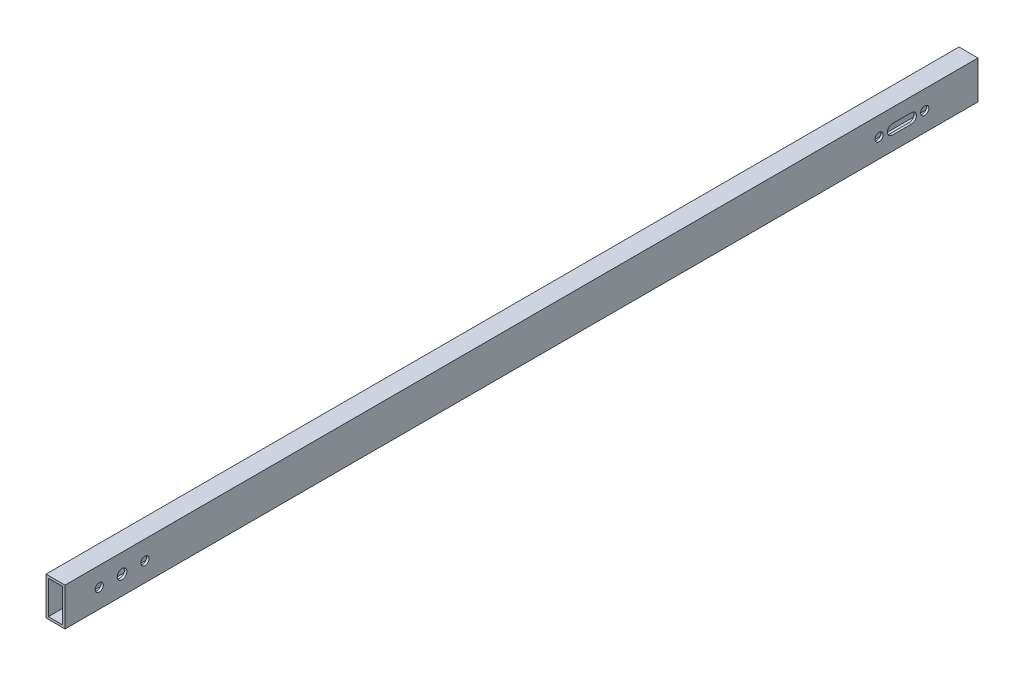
ISO-10303-21;
HEADER;
FILE_DESCRIPTION(('STEP AP214'),'2;1');
FILE_NAME('part.step','',(''),(''),'','','');
FILE_SCHEMA(('AUTOMOTIVE_DESIGN { 1 0 10303 214 1 1 1 1 }'));
ENDSEC;
DATA;
#1=APPLICATION_CONTEXT('core data for automotive mechanical design processes');
#2=APPLICATION_PROTOCOL_DEFINITION('international standard','automotive_design',2000,#1);
#3=PRODUCT_CONTEXT('',#1,'mechanical');
#4=PRODUCT('Part','Part','',(#3));
#5=PRODUCT_RELATED_PRODUCT_CATEGORY('part','',(#4));
#6=PRODUCT_DEFINITION_FORMATION('','',#4);
#7=PRODUCT_DEFINITION_CONTEXT('part definition',#1,'design');
#8=PRODUCT_DEFINITION('design','',#6,#7);
#9=PRODUCT_DEFINITION_SHAPE('','',#8);
#10=(LENGTH_UNIT() NAMED_UNIT(*) SI_UNIT(.MILLI.,.METRE.));
#11=(NAMED_UNIT(*) PLANE_ANGLE_UNIT() SI_UNIT($,.RADIAN.));
#12=(NAMED_UNIT(*) SI_UNIT($,.STERADIAN.) SOLID_ANGLE_UNIT());
#13=UNCERTAINTY_MEASURE_WITH_UNIT(LENGTH_MEASURE(1.E-05),#10,'distance_accuracy_value','');
#14=(GEOMETRIC_REPRESENTATION_CONTEXT(3) GLOBAL_UNCERTAINTY_ASSIGNED_CONTEXT((#13)) GLOBAL_UNIT_ASSIGNED_CONTEXT((#10,
#11,#12)) REPRESENTATION_CONTEXT('',''));
#15=CARTESIAN_POINT('',(0.,0.,0.));
#16=DIRECTION('',(0.,0.,1.));
#17=DIRECTION('',(1.,0.,0.));
#18=AXIS2_PLACEMENT_3D('',#15,#16,#17);
#19=CARTESIAN_POINT('',(0.,0.,609.6));
#20=DIRECTION('',(0.,0.,-1.));
#21=DIRECTION('',(-1.,0.,0.));
#22=AXIS2_PLACEMENT_3D('',#19,#20,#21);
#23=PLANE('',#22);
#24=DIRECTION('',(0.,1.,0.));
#25=VECTOR('',#24,1.);
#26=CARTESIAN_POINT('',(6.35,-12.7,609.6));
#27=LINE('',#26,#25);
#28=CARTESIAN_POINT('',(6.35,-12.7,609.6));
#29=VERTEX_POINT('',#28);
#30=CARTESIAN_POINT('',(6.35,12.7,609.6));
#31=VERTEX_POINT('',#30);
#32=EDGE_CURVE('E341',#29,#31,#27,.T.);
#33=ORIENTED_EDGE('',*,*,#32,.T.);
#34=DIRECTION('',(-1.,0.,0.));
#35=VECTOR('',#34,1.);
#36=CARTESIAN_POINT('',(-6.35,12.7,609.6));
#37=LINE('',#36,#35);
#38=CARTESIAN_POINT('',(-6.35,12.7,609.6));
#39=VERTEX_POINT('',#38);
#40=EDGE_CURVE('E344',#31,#39,#37,.T.);
#41=ORIENTED_EDGE('',*,*,#40,.T.);
#42=DIRECTION('',(0.,-1.,0.));
#43=VECTOR('',#42,1.);
#44=CARTESIAN_POINT('',(-6.35,-12.7,609.6));
#45=LINE('',#44,#43);
#46=CARTESIAN_POINT('',(-6.35,-12.7,609.6));
#47=VERTEX_POINT('',#46);
#48=EDGE_CURVE('E347',#39,#47,#45,.T.);
#49=ORIENTED_EDGE('',*,*,#48,.T.);
#50=DIRECTION('',(1.,0.,0.));
#51=VECTOR('',#50,1.);
#52=CARTESIAN_POINT('',(-6.35,-12.7,609.6));
#53=LINE('',#52,#51);
#54=EDGE_CURVE('E349',#47,#29,#53,.T.);
#55=ORIENTED_EDGE('',*,*,#54,.T.);
#56=EDGE_LOOP('',(#33,#41,#49,#55));
#57=FACE_BOUND('',#56,.T.);
#58=DIRECTION('',(0.,1.,0.));
#59=VECTOR('',#58,1.);
#60=CARTESIAN_POINT('',(4.7625,-11.1125,609.6));
#61=LINE('',#60,#59);
#62=CARTESIAN_POINT('',(4.7625,-11.1125,609.6));
#63=VERTEX_POINT('',#62);
#64=CARTESIAN_POINT('',(4.7625,11.1125,609.6));
#65=VERTEX_POINT('',#64);
#66=EDGE_CURVE('E310',#63,#65,#61,.T.);
#67=ORIENTED_EDGE('',*,*,#66,.F.);
#68=DIRECTION('',(1.,0.,0.));
#69=VECTOR('',#68,1.);
#70=CARTESIAN_POINT('',(-4.7625,-11.1125,609.6));
#71=LINE('',#70,#69);
#72=CARTESIAN_POINT('',(-4.7625,-11.1125,609.6));
#73=VERTEX_POINT('',#72);
#74=EDGE_CURVE('E318',#73,#63,#71,.T.);
#75=ORIENTED_EDGE('',*,*,#74,.F.);
#76=DIRECTION('',(0.,-1.,0.));
#77=VECTOR('',#76,1.);
#78=CARTESIAN_POINT('',(-4.7625,-11.1125,609.6));
#79=LINE('',#78,#77);
#80=CARTESIAN_POINT('',(-4.7625,11.1125,609.6));
#81=VERTEX_POINT('',#80);
#82=EDGE_CURVE('E315',#81,#73,#79,.T.);
#83=ORIENTED_EDGE('',*,*,#82,.F.);
#84=DIRECTION('',(-1.,0.,0.));
#85=VECTOR('',#84,1.);
#86=CARTESIAN_POINT('',(-4.7625,11.1125,609.6));
#87=LINE('',#86,#85);
#88=EDGE_CURVE('E312',#65,#81,#87,.T.);
#89=ORIENTED_EDGE('',*,*,#88,.F.);
#90=EDGE_LOOP('',(#67,#75,#83,#89));
#91=FACE_BOUND('',#90,.T.);
#92=ADVANCED_FACE('F39',(#57,#91),#23,.F.);
#93=CARTESIAN_POINT('',(0.,0.,0.));
#94=DIRECTION('',(0.,0.,-1.));
#95=DIRECTION('',(-1.,0.,0.));
#96=AXIS2_PLACEMENT_3D('',#93,#94,#95);
#97=PLANE('',#96);
#98=DIRECTION('',(0.,1.,0.));
#99=VECTOR('',#98,1.);
#100=CARTESIAN_POINT('',(6.35,-12.7,0.));
#101=LINE('',#100,#99);
#102=CARTESIAN_POINT('',(6.35,-12.7,0.));
#103=VERTEX_POINT('',#102);
#104=CARTESIAN_POINT('',(6.35,12.7,0.));
#105=VERTEX_POINT('',#104);
#106=EDGE_CURVE('E340',#103,#105,#101,.T.);
#107=ORIENTED_EDGE('',*,*,#106,.F.);
#108=DIRECTION('',(1.,0.,0.));
#109=VECTOR('',#108,1.);
#110=CARTESIAN_POINT('',(-6.35,-12.7,0.));
#111=LINE('',#110,#109);
#112=CARTESIAN_POINT('',(-6.35,-12.7,0.));
#113=VERTEX_POINT('',#112);
#114=EDGE_CURVE('E345',#113,#103,#111,.T.);
#115=ORIENTED_EDGE('',*,*,#114,.F.);
#116=DIRECTION('',(0.,-1.,0.));
#117=VECTOR('',#116,1.);
#118=CARTESIAN_POINT('',(-6.35,-12.7,0.));
#119=LINE('',#118,#117);
#120=CARTESIAN_POINT('',(-6.35,12.7,0.));
#121=VERTEX_POINT('',#120);
#122=EDGE_CURVE('E356',#121,#113,#119,.T.);
#123=ORIENTED_EDGE('',*,*,#122,.F.);
#124=DIRECTION('',(-1.,0.,0.));
#125=VECTOR('',#124,1.);
#126=CARTESIAN_POINT('',(-6.35,12.7,0.));
#127=LINE('',#126,#125);
#128=EDGE_CURVE('E354',#105,#121,#127,.T.);
#129=ORIENTED_EDGE('',*,*,#128,.F.);
#130=EDGE_LOOP('',(#107,#115,#123,#129));
#131=FACE_BOUND('',#130,.T.);
#132=DIRECTION('',(1.,0.,0.));
#133=VECTOR('',#132,1.);
#134=CARTESIAN_POINT('',(-4.7625,-11.1125,0.));
#135=LINE('',#134,#133);
#136=CARTESIAN_POINT('',(-4.7625,-11.1125,0.));
#137=VERTEX_POINT('',#136);
#138=CARTESIAN_POINT('',(4.7625,-11.1125,0.));
#139=VERTEX_POINT('',#138);
#140=EDGE_CURVE('E313',#137,#139,#135,.T.);
#141=ORIENTED_EDGE('',*,*,#140,.T.);
#142=DIRECTION('',(0.,1.,0.));
#143=VECTOR('',#142,1.);
#144=CARTESIAN_POINT('',(4.7625,-11.1125,0.));
#145=LINE('',#144,#143);
#146=CARTESIAN_POINT('',(4.7625,11.1125,0.));
#147=VERTEX_POINT('',#146);
#148=EDGE_CURVE('E309',#139,#147,#145,.T.);
#149=ORIENTED_EDGE('',*,*,#148,.T.);
#150=DIRECTION('',(-1.,0.,0.));
#151=VECTOR('',#150,1.);
#152=CARTESIAN_POINT('',(-4.7625,11.1125,0.));
#153=LINE('',#152,#151);
#154=CARTESIAN_POINT('',(-4.7625,11.1125,0.));
#155=VERTEX_POINT('',#154);
#156=EDGE_CURVE('E323',#147,#155,#153,.T.);
#157=ORIENTED_EDGE('',*,*,#156,.T.);
#158=DIRECTION('',(0.,-1.,0.));
#159=VECTOR('',#158,1.);
#160=CARTESIAN_POINT('',(-4.7625,-11.1125,0.));
#161=LINE('',#160,#159);
#162=EDGE_CURVE('E326',#155,#137,#161,.T.);
#163=ORIENTED_EDGE('',*,*,#162,.T.);
#164=EDGE_LOOP('',(#141,#149,#157,#163));
#165=FACE_BOUND('',#164,.T.);
#166=ADVANCED_FACE('F374',(#131,#165),#97,.T.);
#167=CARTESIAN_POINT('',(6.35,-12.7,609.6));
#168=DIRECTION('',(-1.,0.,0.));
#169=DIRECTION('',(0.,0.,1.));
#170=AXIS2_PLACEMENT_3D('',#167,#168,#169);
#171=PLANE('',#170);
#172=CARTESIAN_POINT('',(6.35,0.,35.5600000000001));
#173=DIRECTION('',(1.,0.,0.));
#174=DIRECTION('',(0.,0.,1.));
#175=AXIS2_PLACEMENT_3D('',#172,#173,#174);
#176=CIRCLE('',#175,2.74999999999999);
#177=CARTESIAN_POINT('',(6.35,0.,38.3100000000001));
#178=VERTEX_POINT('',#177);
#179=EDGE_CURVE('E223',#178,#178,#176,.T.);
#180=ORIENTED_EDGE('',*,*,#179,.F.);
#181=EDGE_LOOP('',(#180));
#182=FACE_BOUND('',#181,.T.);
#183=DIRECTION('',(0.,0.,1.));
#184=VECTOR('',#183,1.);
#185=CARTESIAN_POINT('',(6.35,3.30200000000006,44.4500000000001));
#186=LINE('',#185,#184);
#187=CARTESIAN_POINT('',(6.35,3.30200000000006,44.4500000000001));
#188=VERTEX_POINT('',#187);
#189=CARTESIAN_POINT('',(6.35,3.30200000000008,57.1500000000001));
#190=VERTEX_POINT('',#189);
#191=EDGE_CURVE('E260',#188,#190,#186,.T.);
#192=ORIENTED_EDGE('',*,*,#191,.F.);
#193=CARTESIAN_POINT('',(6.35,0.,44.4500000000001));
#194=DIRECTION('',(1.,0.,0.));
#195=DIRECTION('',(0.,0.,-1.));
#196=AXIS2_PLACEMENT_3D('',#193,#194,#195);
#197=CIRCLE('',#196,3.302);
#198=CARTESIAN_POINT('',(6.35,-3.30199999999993,44.4500000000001));
#199=VERTEX_POINT('',#198);
#200=EDGE_CURVE('E258',#199,#188,#197,.T.);
#201=ORIENTED_EDGE('',*,*,#200,.F.);
#202=DIRECTION('',(0.,0.,-1.));
#203=VECTOR('',#202,1.);
#204=CARTESIAN_POINT('',(6.35,-3.30199999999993,44.4500000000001));
#205=LINE('',#204,#203);
#206=CARTESIAN_POINT('',(6.35,-3.30199999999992,57.1500000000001));
#207=VERTEX_POINT('',#206);
#208=EDGE_CURVE('E266',#207,#199,#205,.T.);
#209=ORIENTED_EDGE('',*,*,#208,.F.);
#210=CARTESIAN_POINT('',(6.35,0.,57.1500000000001));
#211=DIRECTION('',(1.,0.,0.));
#212=DIRECTION('',(0.,0.,-1.));
#213=AXIS2_PLACEMENT_3D('',#210,#211,#212);
#214=CIRCLE('',#213,3.302);
#215=EDGE_CURVE('E263',#190,#207,#214,.T.);
#216=ORIENTED_EDGE('',*,*,#215,.F.);
#217=EDGE_LOOP('',(#192,#201,#209,#216));
#218=FACE_BOUND('',#217,.T.);
#219=CARTESIAN_POINT('',(6.35,0.,586.74));
#220=DIRECTION('',(1.,0.,0.));
#221=DIRECTION('',(0.,0.,-1.));
#222=AXIS2_PLACEMENT_3D('',#219,#220,#221);
#223=CIRCLE('',#222,2.75000000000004);
#224=CARTESIAN_POINT('',(6.35,0.,583.99));
#225=VERTEX_POINT('',#224);
#226=EDGE_CURVE('E254',#225,#225,#223,.T.);
#227=ORIENTED_EDGE('',*,*,#226,.F.);
#228=EDGE_LOOP('',(#227));
#229=FACE_BOUND('',#228,.T.);
#230=CARTESIAN_POINT('',(6.35,0.,556.26));
#231=DIRECTION('',(1.,0.,0.));
#232=DIRECTION('',(0.,0.,1.));
#233=AXIS2_PLACEMENT_3D('',#230,#231,#232);
#234=CIRCLE('',#233,2.75000000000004);
#235=CARTESIAN_POINT('',(6.35,0.,559.01));
#236=VERTEX_POINT('',#235);
#237=EDGE_CURVE('E251',#236,#236,#234,.T.);
#238=ORIENTED_EDGE('',*,*,#237,.F.);
#239=EDGE_LOOP('',(#238));
#240=FACE_BOUND('',#239,.T.);
#241=CARTESIAN_POINT('',(6.35,0.,66.0400000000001));
#242=DIRECTION('',(1.,0.,0.));
#243=DIRECTION('',(0.,0.,-1.));
#244=AXIS2_PLACEMENT_3D('',#241,#242,#243);
#245=CIRCLE('',#244,2.75000000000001);
#246=CARTESIAN_POINT('',(6.35,0.,63.2900000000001));
#247=VERTEX_POINT('',#246);
#248=EDGE_CURVE('E255',#247,#247,#245,.T.);
#249=ORIENTED_EDGE('',*,*,#248,.F.);
#250=EDGE_LOOP('',(#249));
#251=FACE_BOUND('',#250,.T.);
#252=CARTESIAN_POINT('',(6.35,0.,571.5));
#253=DIRECTION('',(1.,0.,0.));
#254=DIRECTION('',(0.,0.,-1.));
#255=AXIS2_PLACEMENT_3D('',#252,#253,#254);
#256=CIRCLE('',#255,3.24999999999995);
#257=CARTESIAN_POINT('',(6.35,0.,568.25));
#258=VERTEX_POINT('',#257);
#259=EDGE_CURVE('E272',#258,#258,#256,.T.);
#260=ORIENTED_EDGE('',*,*,#259,.F.);
#261=EDGE_LOOP('',(#260));
#262=FACE_BOUND('',#261,.T.);
#263=ORIENTED_EDGE('',*,*,#106,.T.);
#264=DIRECTION('',(0.,0.,-1.));
#265=VECTOR('',#264,1.);
#266=CARTESIAN_POINT('',(6.35,12.7,609.6));
#267=LINE('',#266,#265);
#268=EDGE_CURVE('E11',#31,#105,#267,.T.);
#269=ORIENTED_EDGE('',*,*,#268,.F.);
#270=ORIENTED_EDGE('',*,*,#32,.F.);
#271=DIRECTION('',(0.,0.,-1.));
#272=VECTOR('',#271,1.);
#273=CARTESIAN_POINT('',(6.35,-12.7,609.6));
#274=LINE('',#273,#272);
#275=EDGE_CURVE('E351',#29,#103,#274,.T.);
#276=ORIENTED_EDGE('',*,*,#275,.T.);
#277=EDGE_LOOP('',(#263,#269,#270,#276));
#278=FACE_BOUND('',#277,.T.);
#279=ADVANCED_FACE('F41',(#182,#218,#229,#240,#251,#262,#278),#171,.F.);
#280=CARTESIAN_POINT('',(-6.35,12.7,609.6));
#281=DIRECTION('',(0.,-1.,0.));
#282=DIRECTION('',(0.,0.,-1.));
#283=AXIS2_PLACEMENT_3D('',#280,#281,#282);
#284=PLANE('',#283);
#285=ORIENTED_EDGE('',*,*,#128,.T.);
#286=DIRECTION('',(0.,0.,-1.));
#287=VECTOR('',#286,1.);
#288=CARTESIAN_POINT('',(-6.35,12.7,609.6));
#289=LINE('',#288,#287);
#290=EDGE_CURVE('E47',#39,#121,#289,.T.);
#291=ORIENTED_EDGE('',*,*,#290,.F.);
#292=ORIENTED_EDGE('',*,*,#40,.F.);
#293=ORIENTED_EDGE('',*,*,#268,.T.);
#294=EDGE_LOOP('',(#285,#291,#292,#293));
#295=FACE_BOUND('',#294,.T.);
#296=ADVANCED_FACE('F385',(#295),#284,.F.);
#297=CARTESIAN_POINT('',(-6.35,-12.7,609.6));
#298=DIRECTION('',(1.,0.,0.));
#299=DIRECTION('',(0.,0.,-1.));
#300=AXIS2_PLACEMENT_3D('',#297,#298,#299);
#301=PLANE('',#300);
#302=CARTESIAN_POINT('',(-6.35,0.,66.0400000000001));
#303=DIRECTION('',(-1.,0.,0.));
#304=DIRECTION('',(0.,0.,1.));
#305=AXIS2_PLACEMENT_3D('',#302,#303,#304);
#306=CIRCLE('',#305,5.);
#307=CARTESIAN_POINT('',(-6.35,-5.,66.0400000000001));
#308=VERTEX_POINT('',#307);
#309=CARTESIAN_POINT('',(-6.35,5.,66.0400000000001));
#310=VERTEX_POINT('',#309);
#311=EDGE_CURVE('E192',#308,#310,#306,.T.);
#312=ORIENTED_EDGE('',*,*,#311,.F.);
#313=DIRECTION('',(0.,0.,1.));
#314=VECTOR('',#313,1.);
#315=CARTESIAN_POINT('',(-6.35,-5.,35.5600000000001));
#316=LINE('',#315,#314);
#317=CARTESIAN_POINT('',(-6.35,-5.,35.5600000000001));
#318=VERTEX_POINT('',#317);
#319=EDGE_CURVE('E213',#318,#308,#316,.T.);
#320=ORIENTED_EDGE('',*,*,#319,.F.);
#321=CARTESIAN_POINT('',(-6.35,0.,35.5600000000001));
#322=DIRECTION('',(-1.,0.,0.));
#323=DIRECTION('',(0.,0.,1.));
#324=AXIS2_PLACEMENT_3D('',#321,#322,#323);
#325=CIRCLE('',#324,5.);
#326=CARTESIAN_POINT('',(-6.35,5.00000000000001,35.5600000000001));
#327=VERTEX_POINT('',#326);
#328=EDGE_CURVE('E210',#327,#318,#325,.T.);
#329=ORIENTED_EDGE('',*,*,#328,.F.);
#330=DIRECTION('',(0.,0.,-1.));
#331=VECTOR('',#330,1.);
#332=CARTESIAN_POINT('',(-6.35,5.,35.5600000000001));
#333=LINE('',#332,#331);
#334=EDGE_CURVE('E54',#310,#327,#333,.T.);
#335=ORIENTED_EDGE('',*,*,#334,.F.);
#336=EDGE_LOOP('',(#312,#320,#329,#335));
#337=FACE_BOUND('',#336,.T.);
#338=CARTESIAN_POINT('',(-6.35,0.,586.74));
#339=DIRECTION('',(-1.,0.,0.));
#340=DIRECTION('',(0.,0.,1.));
#341=AXIS2_PLACEMENT_3D('',#338,#339,#340);
#342=CIRCLE('',#341,5.);
#343=CARTESIAN_POINT('',(-6.35,-5.,586.74));
#344=VERTEX_POINT('',#343);
#345=CARTESIAN_POINT('',(-6.35,5.,586.74));
#346=VERTEX_POINT('',#345);
#347=EDGE_CURVE('E240',#344,#346,#342,.T.);
#348=ORIENTED_EDGE('',*,*,#347,.F.);
#349=DIRECTION('',(0.,0.,1.));
#350=VECTOR('',#349,1.);
#351=CARTESIAN_POINT('',(-6.35,-5.,556.26));
#352=LINE('',#351,#350);
#353=CARTESIAN_POINT('',(-6.35,-5.,556.26));
#354=VERTEX_POINT('',#353);
#355=EDGE_CURVE('E237',#354,#344,#352,.T.);
#356=ORIENTED_EDGE('',*,*,#355,.F.);
#357=CARTESIAN_POINT('',(-6.35,0.,556.26));
#358=DIRECTION('',(-1.,0.,0.));
#359=DIRECTION('',(0.,0.,1.));
#360=AXIS2_PLACEMENT_3D('',#357,#358,#359);
#361=CIRCLE('',#360,5.);
#362=CARTESIAN_POINT('',(-6.35,5.,556.26));
#363=VERTEX_POINT('',#362);
#364=EDGE_CURVE('E234',#363,#354,#361,.T.);
#365=ORIENTED_EDGE('',*,*,#364,.F.);
#366=DIRECTION('',(0.,0.,-1.));
#367=VECTOR('',#366,1.);
#368=CARTESIAN_POINT('',(-6.35,5.,556.26));
#369=LINE('',#368,#367);
#370=EDGE_CURVE('E62',#346,#363,#369,.T.);
#371=ORIENTED_EDGE('',*,*,#370,.F.);
#372=EDGE_LOOP('',(#348,#356,#365,#371));
#373=FACE_BOUND('',#372,.T.);
#374=ORIENTED_EDGE('',*,*,#122,.T.);
#375=DIRECTION('',(0.,0.,-1.));
#376=VECTOR('',#375,1.);
#377=CARTESIAN_POINT('',(-6.35,-12.7,609.6));
#378=LINE('',#377,#376);
#379=EDGE_CURVE('E361',#47,#113,#378,.T.);
#380=ORIENTED_EDGE('',*,*,#379,.F.);
#381=ORIENTED_EDGE('',*,*,#48,.F.);
#382=ORIENTED_EDGE('',*,*,#290,.T.);
#383=EDGE_LOOP('',(#374,#380,#381,#382));
#384=FACE_BOUND('',#383,.T.);
#385=ADVANCED_FACE('F368',(#337,#373,#384),#301,.F.);
#386=CARTESIAN_POINT('',(-6.35,-12.7,609.6));
#387=DIRECTION('',(0.,1.,0.));
#388=DIRECTION('',(0.,0.,1.));
#389=AXIS2_PLACEMENT_3D('',#386,#387,#388);
#390=PLANE('',#389);
#391=CARTESIAN_POINT('',(0.,-12.7,596.9));
#392=DIRECTION('',(0.,-1.,0.));
#393=DIRECTION('',(0.,0.,-1.));
#394=AXIS2_PLACEMENT_3D('',#391,#392,#393);
#395=CIRCLE('',#394,2.74999999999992);
#396=CARTESIAN_POINT('',(0.,-12.7,594.15));
#397=VERTEX_POINT('',#396);
#398=EDGE_CURVE('E228',#397,#397,#395,.T.);
#399=ORIENTED_EDGE('',*,*,#398,.F.);
#400=EDGE_LOOP('',(#399));
#401=FACE_BOUND('',#400,.T.);
#402=CARTESIAN_POINT('',(0.,-12.7,12.7000000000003));
#403=DIRECTION('',(0.,-1.,0.));
#404=DIRECTION('',(0.,0.,1.));
#405=AXIS2_PLACEMENT_3D('',#402,#403,#404);
#406=CIRCLE('',#405,2.74999999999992);
#407=CARTESIAN_POINT('',(0.,-12.7,9.95000000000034));
#408=VERTEX_POINT('',#407);
#409=EDGE_CURVE('E416',#408,#408,#406,.T.);
#410=ORIENTED_EDGE('',*,*,#409,.F.);
#411=EDGE_LOOP('',(#410));
#412=FACE_BOUND('',#411,.T.);
#413=ORIENTED_EDGE('',*,*,#114,.T.);
#414=ORIENTED_EDGE('',*,*,#275,.F.);
#415=ORIENTED_EDGE('',*,*,#54,.F.);
#416=ORIENTED_EDGE('',*,*,#379,.T.);
#417=EDGE_LOOP('',(#413,#414,#415,#416));
#418=FACE_BOUND('',#417,.T.);
#419=ADVANCED_FACE('F378',(#401,#412,#418),#390,.F.);
#420=CARTESIAN_POINT('',(4.7625,-11.1125,609.6));
#421=DIRECTION('',(-1.,0.,0.));
#422=DIRECTION('',(0.,0.,1.));
#423=AXIS2_PLACEMENT_3D('',#420,#421,#422);
#424=PLANE('',#423);
#425=CARTESIAN_POINT('',(4.7625,0.,35.5600000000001));
#426=DIRECTION('',(-1.,0.,0.));
#427=DIRECTION('',(0.,0.,1.));
#428=AXIS2_PLACEMENT_3D('',#425,#426,#427);
#429=CIRCLE('',#428,2.74999999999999);
#430=CARTESIAN_POINT('',(4.7625,0.,38.3100000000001));
#431=VERTEX_POINT('',#430);
#432=EDGE_CURVE('E306',#431,#431,#429,.T.);
#433=ORIENTED_EDGE('',*,*,#432,.F.);
#434=EDGE_LOOP('',(#433));
#435=FACE_BOUND('',#434,.T.);
#436=CARTESIAN_POINT('',(4.7625,0.,44.4500000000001));
#437=DIRECTION('',(-1.,0.,0.));
#438=DIRECTION('',(0.,0.,1.));
#439=AXIS2_PLACEMENT_3D('',#436,#437,#438);
#440=CIRCLE('',#439,3.302);
#441=CARTESIAN_POINT('',(4.7625,3.30200000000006,44.4500000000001));
#442=VERTEX_POINT('',#441);
#443=CARTESIAN_POINT('',(4.7625,-3.30199999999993,44.4500000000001));
#444=VERTEX_POINT('',#443);
#445=EDGE_CURVE('E304',#442,#444,#440,.T.);
#446=ORIENTED_EDGE('',*,*,#445,.F.);
#447=DIRECTION('',(0.,0.,-1.));
#448=VECTOR('',#447,1.);
#449=CARTESIAN_POINT('',(4.7625,3.30200000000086,609.6));
#450=LINE('',#449,#448);
#451=CARTESIAN_POINT('',(4.7625,3.30200000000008,57.15));
#452=VERTEX_POINT('',#451);
#453=EDGE_CURVE('E297',#452,#442,#450,.T.);
#454=ORIENTED_EDGE('',*,*,#453,.F.);
#455=CARTESIAN_POINT('',(4.7625,0.,57.1500000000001));
#456=DIRECTION('',(-1.,0.,0.));
#457=DIRECTION('',(0.,0.,1.));
#458=AXIS2_PLACEMENT_3D('',#455,#456,#457);
#459=CIRCLE('',#458,3.302);
#460=CARTESIAN_POINT('',(4.7625,-3.30199999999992,57.1500000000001));
#461=VERTEX_POINT('',#460);
#462=EDGE_CURVE('E299',#461,#452,#459,.T.);
#463=ORIENTED_EDGE('',*,*,#462,.F.);
#464=DIRECTION('',(0.,0.,1.));
#465=VECTOR('',#464,1.);
#466=CARTESIAN_POINT('',(4.7625,-3.30199999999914,609.6));
#467=LINE('',#466,#465);
#468=EDGE_CURVE('E302',#444,#461,#467,.T.);
#469=ORIENTED_EDGE('',*,*,#468,.F.);
#470=EDGE_LOOP('',(#446,#454,#463,#469));
#471=FACE_BOUND('',#470,.T.);
#472=CARTESIAN_POINT('',(4.7625,0.,586.74));
#473=DIRECTION('',(-1.,0.,0.));
#474=DIRECTION('',(0.,0.,1.));
#475=AXIS2_PLACEMENT_3D('',#472,#473,#474);
#476=CIRCLE('',#475,2.75000000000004);
#477=CARTESIAN_POINT('',(4.7625,0.,589.49));
#478=VERTEX_POINT('',#477);
#479=EDGE_CURVE('E294',#478,#478,#476,.T.);
#480=ORIENTED_EDGE('',*,*,#479,.F.);
#481=EDGE_LOOP('',(#480));
#482=FACE_BOUND('',#481,.T.);
#483=CARTESIAN_POINT('',(4.7625,0.,556.26));
#484=DIRECTION('',(-1.,0.,0.));
#485=DIRECTION('',(0.,0.,1.));
#486=AXIS2_PLACEMENT_3D('',#483,#484,#485);
#487=CIRCLE('',#486,2.75000000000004);
#488=CARTESIAN_POINT('',(4.7625,0.,559.01));
#489=VERTEX_POINT('',#488);
#490=EDGE_CURVE('E291',#489,#489,#487,.T.);
#491=ORIENTED_EDGE('',*,*,#490,.F.);
#492=EDGE_LOOP('',(#491));
#493=FACE_BOUND('',#492,.T.);
#494=CARTESIAN_POINT('',(4.7625,0.,66.0400000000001));
#495=DIRECTION('',(-1.,0.,0.));
#496=DIRECTION('',(0.,0.,1.));
#497=AXIS2_PLACEMENT_3D('',#494,#495,#496);
#498=CIRCLE('',#497,2.75000000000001);
#499=CARTESIAN_POINT('',(4.7625,0.,68.7900000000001));
#500=VERTEX_POINT('',#499);
#501=EDGE_CURVE('E288',#500,#500,#498,.T.);
#502=ORIENTED_EDGE('',*,*,#501,.F.);
#503=EDGE_LOOP('',(#502));
#504=FACE_BOUND('',#503,.T.);
#505=CARTESIAN_POINT('',(4.7625,0.,571.5));
#506=DIRECTION('',(-1.,0.,0.));
#507=DIRECTION('',(0.,0.,1.));
#508=AXIS2_PLACEMENT_3D('',#505,#506,#507);
#509=CIRCLE('',#508,3.24999999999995);
#510=CARTESIAN_POINT('',(4.7625,0.,574.75));
#511=VERTEX_POINT('',#510);
#512=EDGE_CURVE('E285',#511,#511,#509,.T.);
#513=ORIENTED_EDGE('',*,*,#512,.F.);
#514=EDGE_LOOP('',(#513));
#515=FACE_BOUND('',#514,.T.);
#516=ORIENTED_EDGE('',*,*,#148,.F.);
#517=DIRECTION('',(0.,0.,-1.));
#518=VECTOR('',#517,1.);
#519=CARTESIAN_POINT('',(4.7625,-11.1125,609.6));
#520=LINE('',#519,#518);
#521=EDGE_CURVE('E320',#63,#139,#520,.T.);
#522=ORIENTED_EDGE('',*,*,#521,.F.);
#523=ORIENTED_EDGE('',*,*,#66,.T.);
#524=DIRECTION('',(0.,0.,-1.));
#525=VECTOR('',#524,1.);
#526=CARTESIAN_POINT('',(4.7625,11.1125,609.6));
#527=LINE('',#526,#525);
#528=EDGE_CURVE('E337',#65,#147,#527,.T.);
#529=ORIENTED_EDGE('',*,*,#528,.T.);
#530=EDGE_LOOP('',(#516,#522,#523,#529));
#531=FACE_BOUND('',#530,.T.);
#532=ADVANCED_FACE('F401',(#435,#471,#482,#493,#504,#515,#531),#424,.T.);
#533=CARTESIAN_POINT('',(-4.7625,11.1125,609.6));
#534=DIRECTION('',(0.,-1.,0.));
#535=DIRECTION('',(0.,0.,-1.));
#536=AXIS2_PLACEMENT_3D('',#533,#534,#535);
#537=PLANE('',#536);
#538=ORIENTED_EDGE('',*,*,#156,.F.);
#539=ORIENTED_EDGE('',*,*,#528,.F.);
#540=ORIENTED_EDGE('',*,*,#88,.T.);
#541=DIRECTION('',(0.,0.,-1.));
#542=VECTOR('',#541,1.);
#543=CARTESIAN_POINT('',(-4.7625,11.1125,609.6));
#544=LINE('',#543,#542);
#545=EDGE_CURVE('E335',#81,#155,#544,.T.);
#546=ORIENTED_EDGE('',*,*,#545,.T.);
#547=EDGE_LOOP('',(#538,#539,#540,#546));
#548=FACE_BOUND('',#547,.T.);
#549=ADVANCED_FACE('F409',(#548),#537,.T.);
#550=CARTESIAN_POINT('',(-4.7625,-11.1125,609.6));
#551=DIRECTION('',(1.,0.,0.));
#552=DIRECTION('',(0.,0.,-1.));
#553=AXIS2_PLACEMENT_3D('',#550,#551,#552);
#554=PLANE('',#553);
#555=DIRECTION('',(0.,0.,1.));
#556=VECTOR('',#555,1.);
#557=CARTESIAN_POINT('',(-4.7625,-5.,35.5600000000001));
#558=LINE('',#557,#556);
#559=CARTESIAN_POINT('',(-4.7625,-5.,35.5600000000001));
#560=VERTEX_POINT('',#559);
#561=CARTESIAN_POINT('',(-4.7625,-5.,66.0400000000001));
#562=VERTEX_POINT('',#561);
#563=EDGE_CURVE('E199',#560,#562,#558,.T.);
#564=ORIENTED_EDGE('',*,*,#563,.T.);
#565=CARTESIAN_POINT('',(-4.7625,0.,66.0400000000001));
#566=DIRECTION('',(1.,0.,0.));
#567=DIRECTION('',(0.,0.,-1.));
#568=AXIS2_PLACEMENT_3D('',#565,#566,#567);
#569=CIRCLE('',#568,5.);
#570=CARTESIAN_POINT('',(-4.7625,5.,66.0400000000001));
#571=VERTEX_POINT('',#570);
#572=EDGE_CURVE('E186',#562,#571,#569,.F.);
#573=ORIENTED_EDGE('',*,*,#572,.T.);
#574=DIRECTION('',(0.,0.,-1.));
#575=VECTOR('',#574,1.);
#576=CARTESIAN_POINT('',(-4.7625,5.,35.5600000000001));
#577=LINE('',#576,#575);
#578=CARTESIAN_POINT('',(-4.7625,5.,35.5600000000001));
#579=VERTEX_POINT('',#578);
#580=EDGE_CURVE('E176',#571,#579,#577,.T.);
#581=ORIENTED_EDGE('',*,*,#580,.T.);
#582=CARTESIAN_POINT('',(-4.7625,0.,35.5600000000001));
#583=DIRECTION('',(1.,0.,0.));
#584=DIRECTION('',(0.,0.,-1.));
#585=AXIS2_PLACEMENT_3D('',#582,#583,#584);
#586=CIRCLE('',#585,5.);
#587=EDGE_CURVE('E185',#579,#560,#586,.F.);
#588=ORIENTED_EDGE('',*,*,#587,.T.);
#589=EDGE_LOOP('',(#564,#573,#581,#588));
#590=FACE_BOUND('',#589,.T.);
#591=DIRECTION('',(0.,0.,1.));
#592=VECTOR('',#591,1.);
#593=CARTESIAN_POINT('',(-4.7625,-5.,556.26));
#594=LINE('',#593,#592);
#595=CARTESIAN_POINT('',(-4.7625,-5.,556.26));
#596=VERTEX_POINT('',#595);
#597=CARTESIAN_POINT('',(-4.7625,-5.,586.74));
#598=VERTEX_POINT('',#597);
#599=EDGE_CURVE('E200',#596,#598,#594,.T.);
#600=ORIENTED_EDGE('',*,*,#599,.T.);
#601=CARTESIAN_POINT('',(-4.7625,0.,586.74));
#602=DIRECTION('',(1.,0.,0.));
#603=DIRECTION('',(0.,0.,-1.));
#604=AXIS2_PLACEMENT_3D('',#601,#602,#603);
#605=CIRCLE('',#604,5.);
#606=CARTESIAN_POINT('',(-4.7625,5.,586.74));
#607=VERTEX_POINT('',#606);
#608=EDGE_CURVE('E224',#598,#607,#605,.F.);
#609=ORIENTED_EDGE('',*,*,#608,.T.);
#610=DIRECTION('',(0.,0.,-1.));
#611=VECTOR('',#610,1.);
#612=CARTESIAN_POINT('',(-4.7625,5.,556.26));
#613=LINE('',#612,#611);
#614=CARTESIAN_POINT('',(-4.7625,5.,556.26));
#615=VERTEX_POINT('',#614);
#616=EDGE_CURVE('E227',#607,#615,#613,.T.);
#617=ORIENTED_EDGE('',*,*,#616,.T.);
#618=CARTESIAN_POINT('',(-4.7625,0.,556.26));
#619=DIRECTION('',(1.,0.,0.));
#620=DIRECTION('',(0.,0.,-1.));
#621=AXIS2_PLACEMENT_3D('',#618,#619,#620);
#622=CIRCLE('',#621,5.);
#623=EDGE_CURVE('E231',#615,#596,#622,.F.);
#624=ORIENTED_EDGE('',*,*,#623,.T.);
#625=EDGE_LOOP('',(#600,#609,#617,#624));
#626=FACE_BOUND('',#625,.T.);
#627=ORIENTED_EDGE('',*,*,#162,.F.);
#628=ORIENTED_EDGE('',*,*,#545,.F.);
#629=ORIENTED_EDGE('',*,*,#82,.T.);
#630=DIRECTION('',(0.,0.,-1.));
#631=VECTOR('',#630,1.);
#632=CARTESIAN_POINT('',(-4.7625,-11.1125,609.6));
#633=LINE('',#632,#631);
#634=EDGE_CURVE('E333',#73,#137,#633,.T.);
#635=ORIENTED_EDGE('',*,*,#634,.T.);
#636=EDGE_LOOP('',(#627,#628,#629,#635));
#637=FACE_BOUND('',#636,.T.);
#638=ADVANCED_FACE('F196',(#590,#626,#637),#554,.T.);
#639=CARTESIAN_POINT('',(-4.7625,-11.1125,609.6));
#640=DIRECTION('',(0.,1.,0.));
#641=DIRECTION('',(0.,0.,1.));
#642=AXIS2_PLACEMENT_3D('',#639,#640,#641);
#643=PLANE('',#642);
#644=CARTESIAN_POINT('',(0.,-11.1125,596.9));
#645=DIRECTION('',(0.,1.,0.));
#646=DIRECTION('',(0.,0.,1.));
#647=AXIS2_PLACEMENT_3D('',#644,#645,#646);
#648=CIRCLE('',#647,2.74999999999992);
#649=CARTESIAN_POINT('',(0.,-11.1125,594.15));
#650=VERTEX_POINT('',#649);
#651=EDGE_CURVE('E418',#650,#650,#648,.F.);
#652=ORIENTED_EDGE('',*,*,#651,.T.);
#653=EDGE_LOOP('',(#652));
#654=FACE_BOUND('',#653,.T.);
#655=CARTESIAN_POINT('',(0.,-11.1125,12.7000000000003));
#656=DIRECTION('',(0.,1.,0.));
#657=DIRECTION('',(0.,0.,1.));
#658=AXIS2_PLACEMENT_3D('',#655,#656,#657);
#659=CIRCLE('',#658,2.74999999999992);
#660=CARTESIAN_POINT('',(0.,-11.1125,9.95000000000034));
#661=VERTEX_POINT('',#660);
#662=EDGE_CURVE('E206',#661,#661,#659,.F.);
#663=ORIENTED_EDGE('',*,*,#662,.T.);
#664=EDGE_LOOP('',(#663));
#665=FACE_BOUND('',#664,.T.);
#666=ORIENTED_EDGE('',*,*,#140,.F.);
#667=ORIENTED_EDGE('',*,*,#634,.F.);
#668=ORIENTED_EDGE('',*,*,#74,.T.);
#669=ORIENTED_EDGE('',*,*,#521,.T.);
#670=EDGE_LOOP('',(#666,#667,#668,#669));
#671=FACE_BOUND('',#670,.T.);
#672=ADVANCED_FACE('F498',(#654,#665,#671),#643,.T.);
#673=CARTESIAN_POINT('',(-6.35,0.,571.5));
#674=DIRECTION('',(1.,0.,0.));
#675=DIRECTION('',(0.,0.,-1.));
#676=AXIS2_PLACEMENT_3D('',#673,#674,#675);
#677=CYLINDRICAL_SURFACE('',#676,3.24999999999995);
#678=ORIENTED_EDGE('',*,*,#512,.T.);
#679=EDGE_LOOP('',(#678));
#680=FACE_BOUND('',#679,.T.);
#681=ORIENTED_EDGE('',*,*,#259,.T.);
#682=EDGE_LOOP('',(#681));
#683=FACE_BOUND('',#682,.T.);
#684=ADVANCED_FACE('F472',(#680,#683),#677,.F.);
#685=CARTESIAN_POINT('',(-6.35,0.,66.0400000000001));
#686=DIRECTION('',(1.,0.,0.));
#687=DIRECTION('',(0.,0.,-1.));
#688=AXIS2_PLACEMENT_3D('',#685,#686,#687);
#689=CYLINDRICAL_SURFACE('',#688,2.75000000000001);
#690=ORIENTED_EDGE('',*,*,#501,.T.);
#691=EDGE_LOOP('',(#690));
#692=FACE_BOUND('',#691,.T.);
#693=ORIENTED_EDGE('',*,*,#248,.T.);
#694=EDGE_LOOP('',(#693));
#695=FACE_BOUND('',#694,.T.);
#696=ADVANCED_FACE('F468',(#692,#695),#689,.F.);
#697=CARTESIAN_POINT('',(-6.35,0.,556.26));
#698=DIRECTION('',(1.,0.,0.));
#699=DIRECTION('',(0.,0.,-1.));
#700=AXIS2_PLACEMENT_3D('',#697,#698,#699);
#701=CYLINDRICAL_SURFACE('',#700,2.75000000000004);
#702=ORIENTED_EDGE('',*,*,#490,.T.);
#703=EDGE_LOOP('',(#702));
#704=FACE_BOUND('',#703,.T.);
#705=ORIENTED_EDGE('',*,*,#237,.T.);
#706=EDGE_LOOP('',(#705));
#707=FACE_BOUND('',#706,.T.);
#708=ADVANCED_FACE('F464',(#704,#707),#701,.F.);
#709=CARTESIAN_POINT('',(-6.35,0.,586.74));
#710=DIRECTION('',(1.,0.,0.));
#711=DIRECTION('',(0.,0.,-1.));
#712=AXIS2_PLACEMENT_3D('',#709,#710,#711);
#713=CYLINDRICAL_SURFACE('',#712,2.75000000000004);
#714=ORIENTED_EDGE('',*,*,#479,.T.);
#715=EDGE_LOOP('',(#714));
#716=FACE_BOUND('',#715,.T.);
#717=ORIENTED_EDGE('',*,*,#226,.T.);
#718=EDGE_LOOP('',(#717));
#719=FACE_BOUND('',#718,.T.);
#720=ADVANCED_FACE('F467',(#716,#719),#713,.F.);
#721=CARTESIAN_POINT('',(-6.35,0.,44.4500000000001));
#722=DIRECTION('',(1.,0.,0.));
#723=DIRECTION('',(0.,0.,-1.));
#724=AXIS2_PLACEMENT_3D('',#721,#722,#723);
#725=CYLINDRICAL_SURFACE('',#724,3.302);
#726=ORIENTED_EDGE('',*,*,#445,.T.);
#727=DIRECTION('',(1.,0.,0.));
#728=VECTOR('',#727,1.);
#729=CARTESIAN_POINT('',(-6.35,-3.30199999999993,44.4500000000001));
#730=LINE('',#729,#728);
#731=EDGE_CURVE('E270',#444,#199,#730,.T.);
#732=ORIENTED_EDGE('',*,*,#731,.T.);
#733=ORIENTED_EDGE('',*,*,#200,.T.);
#734=DIRECTION('',(1.,0.,0.));
#735=VECTOR('',#734,1.);
#736=CARTESIAN_POINT('',(-6.35,3.30200000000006,44.4500000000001));
#737=LINE('',#736,#735);
#738=EDGE_CURVE('E269',#442,#188,#737,.T.);
#739=ORIENTED_EDGE('',*,*,#738,.F.);
#740=EDGE_LOOP('',(#726,#732,#733,#739));
#741=FACE_BOUND('',#740,.T.);
#742=ADVANCED_FACE('F478',(#741),#725,.F.);
#743=CARTESIAN_POINT('',(-6.35,-3.30199999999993,44.4500000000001));
#744=DIRECTION('',(0.,-1.,0.));
#745=DIRECTION('',(0.,0.,-1.));
#746=AXIS2_PLACEMENT_3D('',#743,#744,#745);
#747=PLANE('',#746);
#748=ORIENTED_EDGE('',*,*,#468,.T.);
#749=DIRECTION('',(1.,0.,0.));
#750=VECTOR('',#749,1.);
#751=CARTESIAN_POINT('',(-6.35,-3.30199999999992,57.1500000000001));
#752=LINE('',#751,#750);
#753=EDGE_CURVE('E273',#461,#207,#752,.T.);
#754=ORIENTED_EDGE('',*,*,#753,.T.);
#755=ORIENTED_EDGE('',*,*,#208,.T.);
#756=ORIENTED_EDGE('',*,*,#731,.F.);
#757=EDGE_LOOP('',(#748,#754,#755,#756));
#758=FACE_BOUND('',#757,.T.);
#759=ADVANCED_FACE('F474',(#758),#747,.F.);
#760=CARTESIAN_POINT('',(-6.35,0.,57.1500000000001));
#761=DIRECTION('',(1.,0.,0.));
#762=DIRECTION('',(0.,0.,-1.));
#763=AXIS2_PLACEMENT_3D('',#760,#761,#762);
#764=CYLINDRICAL_SURFACE('',#763,3.302);
#765=ORIENTED_EDGE('',*,*,#462,.T.);
#766=DIRECTION('',(1.,0.,0.));
#767=VECTOR('',#766,1.);
#768=CARTESIAN_POINT('',(-6.35,3.30200000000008,57.1500000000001));
#769=LINE('',#768,#767);
#770=EDGE_CURVE('E275',#452,#190,#769,.T.);
#771=ORIENTED_EDGE('',*,*,#770,.T.);
#772=ORIENTED_EDGE('',*,*,#215,.T.);
#773=ORIENTED_EDGE('',*,*,#753,.F.);
#774=EDGE_LOOP('',(#765,#771,#772,#773));
#775=FACE_BOUND('',#774,.T.);
#776=ADVANCED_FACE('F477',(#775),#764,.F.);
#777=CARTESIAN_POINT('',(-6.35,3.30200000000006,44.4500000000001));
#778=DIRECTION('',(0.,1.,0.));
#779=DIRECTION('',(0.,0.,1.));
#780=AXIS2_PLACEMENT_3D('',#777,#778,#779);
#781=PLANE('',#780);
#782=ORIENTED_EDGE('',*,*,#453,.T.);
#783=ORIENTED_EDGE('',*,*,#738,.T.);
#784=ORIENTED_EDGE('',*,*,#191,.T.);
#785=ORIENTED_EDGE('',*,*,#770,.F.);
#786=EDGE_LOOP('',(#782,#783,#784,#785));
#787=FACE_BOUND('',#786,.T.);
#788=ADVANCED_FACE('F482',(#787),#781,.F.);
#789=CARTESIAN_POINT('',(-6.35,0.,35.5600000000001));
#790=DIRECTION('',(1.,0.,0.));
#791=DIRECTION('',(0.,0.,-1.));
#792=AXIS2_PLACEMENT_3D('',#789,#790,#791);
#793=CYLINDRICAL_SURFACE('',#792,2.74999999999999);
#794=ORIENTED_EDGE('',*,*,#432,.T.);
#795=EDGE_LOOP('',(#794));
#796=FACE_BOUND('',#795,.T.);
#797=ORIENTED_EDGE('',*,*,#179,.T.);
#798=EDGE_LOOP('',(#797));
#799=FACE_BOUND('',#798,.T.);
#800=ADVANCED_FACE('F459',(#796,#799),#793,.F.);
#801=CARTESIAN_POINT('',(6.351,-5.,556.26));
#802=DIRECTION('',(0.,-1.,0.));
#803=DIRECTION('',(0.,0.,-1.));
#804=AXIS2_PLACEMENT_3D('',#801,#802,#803);
#805=PLANE('',#804);
#806=DIRECTION('',(-1.,0.,0.));
#807=VECTOR('',#806,1.);
#808=CARTESIAN_POINT('',(6.351,-5.,556.26));
#809=LINE('',#808,#807);
#810=EDGE_CURVE('E244',#596,#354,#809,.T.);
#811=ORIENTED_EDGE('',*,*,#810,.T.);
#812=ORIENTED_EDGE('',*,*,#355,.T.);
#813=DIRECTION('',(-1.,0.,0.));
#814=VECTOR('',#813,1.);
#815=CARTESIAN_POINT('',(6.351,-5.,586.74));
#816=LINE('',#815,#814);
#817=EDGE_CURVE('E248',#598,#344,#816,.T.);
#818=ORIENTED_EDGE('',*,*,#817,.F.);
#819=ORIENTED_EDGE('',*,*,#599,.F.);
#820=EDGE_LOOP('',(#811,#812,#818,#819));
#821=FACE_BOUND('',#820,.T.);
#822=ADVANCED_FACE('F455',(#821),#805,.F.);
#823=CARTESIAN_POINT('',(6.351,0.,586.74));
#824=DIRECTION('',(-1.,0.,0.));
#825=DIRECTION('',(0.,0.,1.));
#826=AXIS2_PLACEMENT_3D('',#823,#824,#825);
#827=CYLINDRICAL_SURFACE('',#826,5.);
#828=ORIENTED_EDGE('',*,*,#817,.T.);
#829=ORIENTED_EDGE('',*,*,#347,.T.);
#830=DIRECTION('',(-1.,0.,0.));
#831=VECTOR('',#830,1.);
#832=CARTESIAN_POINT('',(6.351,5.,586.74));
#833=LINE('',#832,#831);
#834=EDGE_CURVE('E246',#607,#346,#833,.T.);
#835=ORIENTED_EDGE('',*,*,#834,.F.);
#836=ORIENTED_EDGE('',*,*,#608,.F.);
#837=EDGE_LOOP('',(#828,#829,#835,#836));
#838=FACE_BOUND('',#837,.T.);
#839=ADVANCED_FACE('F452',(#838),#827,.F.);
#840=CARTESIAN_POINT('',(6.351,5.,556.26));
#841=DIRECTION('',(0.,1.,0.));
#842=DIRECTION('',(0.,0.,1.));
#843=AXIS2_PLACEMENT_3D('',#840,#841,#842);
#844=PLANE('',#843);
#845=ORIENTED_EDGE('',*,*,#834,.T.);
#846=ORIENTED_EDGE('',*,*,#370,.T.);
#847=DIRECTION('',(-1.,0.,0.));
#848=VECTOR('',#847,1.);
#849=CARTESIAN_POINT('',(6.351,5.,556.26));
#850=LINE('',#849,#848);
#851=EDGE_CURVE('E203',#615,#363,#850,.T.);
#852=ORIENTED_EDGE('',*,*,#851,.F.);
#853=ORIENTED_EDGE('',*,*,#616,.F.);
#854=EDGE_LOOP('',(#845,#846,#852,#853));
#855=FACE_BOUND('',#854,.T.);
#856=ADVANCED_FACE('F449',(#855),#844,.F.);
#857=CARTESIAN_POINT('',(6.351,0.,556.26));
#858=DIRECTION('',(-1.,0.,0.));
#859=DIRECTION('',(0.,0.,1.));
#860=AXIS2_PLACEMENT_3D('',#857,#858,#859);
#861=CYLINDRICAL_SURFACE('',#860,5.);
#862=ORIENTED_EDGE('',*,*,#851,.T.);
#863=ORIENTED_EDGE('',*,*,#364,.T.);
#864=ORIENTED_EDGE('',*,*,#810,.F.);
#865=ORIENTED_EDGE('',*,*,#623,.F.);
#866=EDGE_LOOP('',(#862,#863,#864,#865));
#867=FACE_BOUND('',#866,.T.);
#868=ADVANCED_FACE('F444',(#867),#861,.F.);
#869=CARTESIAN_POINT('',(6.351,-5.,35.5600000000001));
#870=DIRECTION('',(0.,-1.,0.));
#871=DIRECTION('',(0.,0.,-1.));
#872=AXIS2_PLACEMENT_3D('',#869,#870,#871);
#873=PLANE('',#872);
#874=DIRECTION('',(-1.,0.,0.));
#875=VECTOR('',#874,1.);
#876=CARTESIAN_POINT('',(6.351,-5.,35.5600000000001));
#877=LINE('',#876,#875);
#878=EDGE_CURVE('E218',#560,#318,#877,.T.);
#879=ORIENTED_EDGE('',*,*,#878,.T.);
#880=ORIENTED_EDGE('',*,*,#319,.T.);
#881=DIRECTION('',(-1.,0.,0.));
#882=VECTOR('',#881,1.);
#883=CARTESIAN_POINT('',(6.351,-5.,66.0400000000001));
#884=LINE('',#883,#882);
#885=EDGE_CURVE('E193',#562,#308,#884,.T.);
#886=ORIENTED_EDGE('',*,*,#885,.F.);
#887=ORIENTED_EDGE('',*,*,#563,.F.);
#888=EDGE_LOOP('',(#879,#880,#886,#887));
#889=FACE_BOUND('',#888,.T.);
#890=ADVANCED_FACE('F441',(#889),#873,.F.);
#891=CARTESIAN_POINT('',(6.351,0.,66.0400000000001));
#892=DIRECTION('',(-1.,0.,0.));
#893=DIRECTION('',(0.,0.,1.));
#894=AXIS2_PLACEMENT_3D('',#891,#892,#893);
#895=CYLINDRICAL_SURFACE('',#894,5.);
#896=ORIENTED_EDGE('',*,*,#885,.T.);
#897=ORIENTED_EDGE('',*,*,#311,.T.);
#898=DIRECTION('',(-1.,0.,0.));
#899=VECTOR('',#898,1.);
#900=CARTESIAN_POINT('',(6.351,5.,66.0400000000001));
#901=LINE('',#900,#899);
#902=EDGE_CURVE('E179',#571,#310,#901,.T.);
#903=ORIENTED_EDGE('',*,*,#902,.F.);
#904=ORIENTED_EDGE('',*,*,#572,.F.);
#905=EDGE_LOOP('',(#896,#897,#903,#904));
#906=FACE_BOUND('',#905,.T.);
#907=ADVANCED_FACE('F189',(#906),#895,.F.);
#908=CARTESIAN_POINT('',(6.351,5.,35.5600000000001));
#909=DIRECTION('',(0.,1.,0.));
#910=DIRECTION('',(0.,0.,1.));
#911=AXIS2_PLACEMENT_3D('',#908,#909,#910);
#912=PLANE('',#911);
#913=ORIENTED_EDGE('',*,*,#902,.T.);
#914=ORIENTED_EDGE('',*,*,#334,.T.);
#915=DIRECTION('',(-1.,0.,0.));
#916=VECTOR('',#915,1.);
#917=CARTESIAN_POINT('',(6.351,5.,35.5600000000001));
#918=LINE('',#917,#916);
#919=EDGE_CURVE('E181',#579,#327,#918,.T.);
#920=ORIENTED_EDGE('',*,*,#919,.F.);
#921=ORIENTED_EDGE('',*,*,#580,.F.);
#922=EDGE_LOOP('',(#913,#914,#920,#921));
#923=FACE_BOUND('',#922,.T.);
#924=ADVANCED_FACE('F178',(#923),#912,.F.);
#925=CARTESIAN_POINT('',(6.351,0.,35.5600000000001));
#926=DIRECTION('',(-1.,0.,0.));
#927=DIRECTION('',(0.,0.,1.));
#928=AXIS2_PLACEMENT_3D('',#925,#926,#927);
#929=CYLINDRICAL_SURFACE('',#928,5.);
#930=ORIENTED_EDGE('',*,*,#919,.T.);
#931=ORIENTED_EDGE('',*,*,#328,.T.);
#932=ORIENTED_EDGE('',*,*,#878,.F.);
#933=ORIENTED_EDGE('',*,*,#587,.F.);
#934=EDGE_LOOP('',(#930,#931,#932,#933));
#935=FACE_BOUND('',#934,.T.);
#936=ADVANCED_FACE('F432',(#935),#929,.F.);
#937=CARTESIAN_POINT('',(0.,12.701,12.7000000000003));
#938=DIRECTION('',(0.,-1.,0.));
#939=DIRECTION('',(0.,0.,-1.));
#940=AXIS2_PLACEMENT_3D('',#937,#938,#939);
#941=CYLINDRICAL_SURFACE('',#940,2.74999999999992);
#942=CARTESIAN_POINT('',(0.,-11.1125,9.95000000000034));
#943=CARTESIAN_POINT('',(0.,-11.1290364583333,9.95000000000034));
#944=CARTESIAN_POINT('',(0.,-11.1455729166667,9.95000000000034));
#945=CARTESIAN_POINT('',(0.,-11.1786458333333,9.95000000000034));
#946=CARTESIAN_POINT('',(0.,-11.1951822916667,9.95000000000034));
#947=CARTESIAN_POINT('',(0.,-11.2282552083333,9.95000000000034));
#948=CARTESIAN_POINT('',(0.,-11.2447916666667,9.95000000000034));
#949=CARTESIAN_POINT('',(0.,-11.2778645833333,9.95000000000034));
#950=CARTESIAN_POINT('',(0.,-11.2944010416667,9.95000000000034));
#951=CARTESIAN_POINT('',(0.,-11.3274739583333,9.95000000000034));
#952=CARTESIAN_POINT('',(0.,-11.3440104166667,9.95000000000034));
#953=CARTESIAN_POINT('',(0.,-11.3770833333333,9.95000000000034));
#954=CARTESIAN_POINT('',(0.,-11.3936197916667,9.95000000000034));
#955=CARTESIAN_POINT('',(0.,-11.4266927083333,9.95000000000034));
#956=CARTESIAN_POINT('',(0.,-11.4432291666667,9.95000000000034));
#957=CARTESIAN_POINT('',(0.,-11.4763020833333,9.95000000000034));
#958=CARTESIAN_POINT('',(0.,-11.4928385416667,9.95000000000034));
#959=CARTESIAN_POINT('',(0.,-11.5259114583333,9.95000000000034));
#960=CARTESIAN_POINT('',(0.,-11.5424479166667,9.95000000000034));
#961=CARTESIAN_POINT('',(0.,-11.5755208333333,9.95000000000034));
#962=CARTESIAN_POINT('',(0.,-11.5920572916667,9.95000000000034));
#963=CARTESIAN_POINT('',(0.,-11.6251302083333,9.95000000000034));
#964=CARTESIAN_POINT('',(0.,-11.6416666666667,9.95000000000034));
#965=CARTESIAN_POINT('',(0.,-11.6747395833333,9.95000000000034));
#966=CARTESIAN_POINT('',(0.,-11.6912760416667,9.95000000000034));
#967=CARTESIAN_POINT('',(0.,-11.7243489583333,9.95000000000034));
#968=CARTESIAN_POINT('',(0.,-11.7408854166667,9.95000000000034));
#969=CARTESIAN_POINT('',(0.,-11.7739583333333,9.95000000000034));
#970=CARTESIAN_POINT('',(0.,-11.7904947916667,9.95000000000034));
#971=CARTESIAN_POINT('',(0.,-11.8235677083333,9.95000000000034));
#972=CARTESIAN_POINT('',(0.,-11.8401041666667,9.95000000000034));
#973=CARTESIAN_POINT('',(0.,-11.8731770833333,9.95000000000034));
#974=CARTESIAN_POINT('',(0.,-11.8897135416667,9.95000000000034));
#975=CARTESIAN_POINT('',(0.,-11.9227864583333,9.95000000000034));
#976=CARTESIAN_POINT('',(0.,-11.9393229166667,9.95000000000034));
#977=CARTESIAN_POINT('',(0.,-11.9723958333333,9.95000000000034));
#978=CARTESIAN_POINT('',(0.,-11.9889322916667,9.95000000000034));
#979=CARTESIAN_POINT('',(0.,-12.0220052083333,9.95000000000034));
#980=CARTESIAN_POINT('',(0.,-12.0385416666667,9.95000000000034));
#981=CARTESIAN_POINT('',(0.,-12.0716145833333,9.95000000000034));
#982=CARTESIAN_POINT('',(0.,-12.0881510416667,9.95000000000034));
#983=CARTESIAN_POINT('',(0.,-12.1212239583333,9.95000000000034));
#984=CARTESIAN_POINT('',(0.,-12.1377604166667,9.95000000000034));
#985=CARTESIAN_POINT('',(0.,-12.1708333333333,9.95000000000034));
#986=CARTESIAN_POINT('',(0.,-12.1873697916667,9.95000000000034));
#987=CARTESIAN_POINT('',(0.,-12.2204427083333,9.95000000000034));
#988=CARTESIAN_POINT('',(0.,-12.2369791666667,9.95000000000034));
#989=CARTESIAN_POINT('',(0.,-12.2700520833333,9.95000000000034));
#990=CARTESIAN_POINT('',(0.,-12.2865885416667,9.95000000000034));
#991=CARTESIAN_POINT('',(0.,-12.3196614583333,9.95000000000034));
#992=CARTESIAN_POINT('',(0.,-12.3361979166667,9.95000000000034));
#993=CARTESIAN_POINT('',(0.,-12.3692708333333,9.95000000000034));
#994=CARTESIAN_POINT('',(0.,-12.3858072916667,9.95000000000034));
#995=CARTESIAN_POINT('',(0.,-12.4188802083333,9.95000000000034));
#996=CARTESIAN_POINT('',(0.,-12.4354166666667,9.95000000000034));
#997=CARTESIAN_POINT('',(0.,-12.4684895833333,9.95000000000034));
#998=CARTESIAN_POINT('',(0.,-12.4850260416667,9.95000000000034));
#999=CARTESIAN_POINT('',(0.,-12.5180989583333,9.95000000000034));
#1000=CARTESIAN_POINT('',(0.,-12.5346354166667,9.95000000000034));
#1001=CARTESIAN_POINT('',(0.,-12.5677083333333,9.95000000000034));
#1002=CARTESIAN_POINT('',(0.,-12.5842447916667,9.95000000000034));
#1003=CARTESIAN_POINT('',(0.,-12.6173177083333,9.95000000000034));
#1004=CARTESIAN_POINT('',(0.,-12.6338541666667,9.95000000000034));
#1005=CARTESIAN_POINT('',(0.,-12.6669270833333,9.95000000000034));
#1006=CARTESIAN_POINT('',(0.,-12.6834635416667,9.95000000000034));
#1007=CARTESIAN_POINT('',(0.,-12.7,9.95000000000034));
#1008=B_SPLINE_CURVE_WITH_KNOTS('',3,(#942,#943,#944,#945,#946,#947,#948,#949,#950,#951,#952,
#953,#954,#955,#956,#957,#958,#959,#960,#961,#962,#963,#964,#965,#966,#967,#968,#969,#970,#971,
#972,#973,#974,#975,#976,#977,#978,#979,#980,#981,#982,#983,#984,#985,#986,#987,#988,#989,#990,
#991,#992,#993,#994,#995,#996,#997,#998,#999,#1000,#1001,#1002,#1003,#1004,#1005,#1006,#1007),
.UNSPECIFIED.,.F.,.F.,(4,2,2,2,2,2,2,2,2,2,2,2,2,2,2,2,2,2,2,2,2,2,2,2,2,2,2,2,2,2,2,2,4),(0.,
0.0496093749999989,0.0992187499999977,0.148828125,0.198437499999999,0.248046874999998,
0.29765625,0.347265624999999,0.396874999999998,0.446484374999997,0.496093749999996,
0.545703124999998,0.595312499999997,0.644921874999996,0.694531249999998,0.744140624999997,
0.793749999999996,0.843359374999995,0.892968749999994,0.942578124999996,0.992187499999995,
1.04179687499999,1.09140625,1.14101562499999,1.19062499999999,1.24023437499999,1.28984374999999,
1.33945312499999,1.38906249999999,1.43867187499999,1.48828124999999,1.53789062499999,
1.58749999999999),.UNSPECIFIED.);
#1009=EDGE_CURVE('BSEAM426',#661,#408,#1008,.T.);
#1010=ORIENTED_EDGE('',*,*,#662,.F.);
#1011=ORIENTED_EDGE('',*,*,#409,.T.);
#1012=ORIENTED_EDGE('',*,*,#1009,.T.);
#1013=ORIENTED_EDGE('',*,*,#1009,.F.);
#1014=EDGE_LOOP('',(#1010,#1012,#1011,#1013));
#1015=FACE_BOUND('',#1014,.T.);
#1016=ADVANCED_FACE('F426',(#1015),#941,.F.);
#1017=CARTESIAN_POINT('',(0.,12.701,596.9));
#1018=DIRECTION('',(0.,-1.,0.));
#1019=DIRECTION('',(0.,0.,-1.));
#1020=AXIS2_PLACEMENT_3D('',#1017,#1018,#1019);
#1021=CYLINDRICAL_SURFACE('',#1020,2.74999999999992);
#1022=CARTESIAN_POINT('',(0.,-11.1125,594.15));
#1023=CARTESIAN_POINT('',(0.,-11.1290364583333,594.15));
#1024=CARTESIAN_POINT('',(0.,-11.1455729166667,594.15));
#1025=CARTESIAN_POINT('',(0.,-11.1786458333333,594.15));
#1026=CARTESIAN_POINT('',(0.,-11.1951822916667,594.15));
#1027=CARTESIAN_POINT('',(0.,-11.2282552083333,594.15));
#1028=CARTESIAN_POINT('',(0.,-11.2447916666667,594.15));
#1029=CARTESIAN_POINT('',(0.,-11.2778645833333,594.15));
#1030=CARTESIAN_POINT('',(0.,-11.2944010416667,594.15));
#1031=CARTESIAN_POINT('',(0.,-11.3274739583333,594.15));
#1032=CARTESIAN_POINT('',(0.,-11.3440104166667,594.15));
#1033=CARTESIAN_POINT('',(0.,-11.3770833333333,594.15));
#1034=CARTESIAN_POINT('',(0.,-11.3936197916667,594.15));
#1035=CARTESIAN_POINT('',(0.,-11.4266927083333,594.15));
#1036=CARTESIAN_POINT('',(0.,-11.4432291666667,594.15));
#1037=CARTESIAN_POINT('',(0.,-11.4763020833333,594.15));
#1038=CARTESIAN_POINT('',(0.,-11.4928385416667,594.15));
#1039=CARTESIAN_POINT('',(0.,-11.5259114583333,594.15));
#1040=CARTESIAN_POINT('',(0.,-11.5424479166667,594.15));
#1041=CARTESIAN_POINT('',(0.,-11.5755208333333,594.15));
#1042=CARTESIAN_POINT('',(0.,-11.5920572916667,594.15));
#1043=CARTESIAN_POINT('',(0.,-11.6251302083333,594.15));
#1044=CARTESIAN_POINT('',(0.,-11.6416666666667,594.15));
#1045=CARTESIAN_POINT('',(0.,-11.6747395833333,594.15));
#1046=CARTESIAN_POINT('',(0.,-11.6912760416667,594.15));
#1047=CARTESIAN_POINT('',(0.,-11.7243489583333,594.15));
#1048=CARTESIAN_POINT('',(0.,-11.7408854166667,594.15));
#1049=CARTESIAN_POINT('',(0.,-11.7739583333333,594.15));
#1050=CARTESIAN_POINT('',(0.,-11.7904947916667,594.15));
#1051=CARTESIAN_POINT('',(0.,-11.8235677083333,594.15));
#1052=CARTESIAN_POINT('',(0.,-11.8401041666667,594.15));
#1053=CARTESIAN_POINT('',(0.,-11.8731770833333,594.15));
#1054=CARTESIAN_POINT('',(0.,-11.8897135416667,594.15));
#1055=CARTESIAN_POINT('',(0.,-11.9227864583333,594.15));
#1056=CARTESIAN_POINT('',(0.,-11.9393229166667,594.15));
#1057=CARTESIAN_POINT('',(0.,-11.9723958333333,594.15));
#1058=CARTESIAN_POINT('',(0.,-11.9889322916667,594.15));
#1059=CARTESIAN_POINT('',(0.,-12.0220052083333,594.15));
#1060=CARTESIAN_POINT('',(0.,-12.0385416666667,594.15));
#1061=CARTESIAN_POINT('',(0.,-12.0716145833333,594.15));
#1062=CARTESIAN_POINT('',(0.,-12.0881510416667,594.15));
#1063=CARTESIAN_POINT('',(0.,-12.1212239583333,594.15));
#1064=CARTESIAN_POINT('',(0.,-12.1377604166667,594.15));
#1065=CARTESIAN_POINT('',(0.,-12.1708333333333,594.15));
#1066=CARTESIAN_POINT('',(0.,-12.1873697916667,594.15));
#1067=CARTESIAN_POINT('',(0.,-12.2204427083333,594.15));
#1068=CARTESIAN_POINT('',(0.,-12.2369791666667,594.15));
#1069=CARTESIAN_POINT('',(0.,-12.2700520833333,594.15));
#1070=CARTESIAN_POINT('',(0.,-12.2865885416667,594.15));
#1071=CARTESIAN_POINT('',(0.,-12.3196614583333,594.15));
#1072=CARTESIAN_POINT('',(0.,-12.3361979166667,594.15));
#1073=CARTESIAN_POINT('',(0.,-12.3692708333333,594.15));
#1074=CARTESIAN_POINT('',(0.,-12.3858072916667,594.15));
#1075=CARTESIAN_POINT('',(0.,-12.4188802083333,594.15));
#1076=CARTESIAN_POINT('',(0.,-12.4354166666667,594.15));
#1077=CARTESIAN_POINT('',(0.,-12.4684895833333,594.15));
#1078=CARTESIAN_POINT('',(0.,-12.4850260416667,594.15));
#1079=CARTESIAN_POINT('',(0.,-12.5180989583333,594.15));
#1080=CARTESIAN_POINT('',(0.,-12.5346354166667,594.15));
#1081=CARTESIAN_POINT('',(0.,-12.5677083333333,594.15));
#1082=CARTESIAN_POINT('',(0.,-12.5842447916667,594.15));
#1083=CARTESIAN_POINT('',(0.,-12.6173177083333,594.15));
#1084=CARTESIAN_POINT('',(0.,-12.6338541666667,594.15));
#1085=CARTESIAN_POINT('',(0.,-12.6669270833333,594.15));
#1086=CARTESIAN_POINT('',(0.,-12.6834635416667,594.15));
#1087=CARTESIAN_POINT('',(0.,-12.7,594.15));
#1088=B_SPLINE_CURVE_WITH_KNOTS('',3,(#1022,#1023,#1024,#1025,#1026,#1027,#1028,#1029,#1030,
#1031,#1032,#1033,#1034,#1035,#1036,#1037,#1038,#1039,#1040,#1041,#1042,#1043,#1044,#1045,#1046,
#1047,#1048,#1049,#1050,#1051,#1052,#1053,#1054,#1055,#1056,#1057,#1058,#1059,#1060,#1061,#1062,
#1063,#1064,#1065,#1066,#1067,#1068,#1069,#1070,#1071,#1072,#1073,#1074,#1075,#1076,#1077,#1078,
#1079,#1080,#1081,#1082,#1083,#1084,#1085,#1086,#1087),.UNSPECIFIED.,.F.,.F.,(4,2,2,2,2,2,2,2,2,
2,2,2,2,2,2,2,2,2,2,2,2,2,2,2,2,2,2,2,2,2,2,2,4),(0.,0.0496093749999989,0.0992187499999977,
0.148828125,0.198437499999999,0.248046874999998,0.29765625,0.347265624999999,0.396874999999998,
0.446484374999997,0.496093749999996,0.545703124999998,0.595312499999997,0.644921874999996,
0.694531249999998,0.744140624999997,0.793749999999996,0.843359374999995,0.892968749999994,
0.942578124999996,0.992187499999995,1.04179687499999,1.09140625,1.14101562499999,
1.19062499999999,1.24023437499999,1.28984374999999,1.33945312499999,1.38906249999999,
1.43867187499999,1.48828124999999,1.53789062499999,1.58749999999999),.UNSPECIFIED.);
#1089=EDGE_CURVE('BSEAM424',#650,#397,#1088,.T.);
#1090=ORIENTED_EDGE('',*,*,#651,.F.);
#1091=ORIENTED_EDGE('',*,*,#398,.T.);
#1092=ORIENTED_EDGE('',*,*,#1089,.T.);
#1093=ORIENTED_EDGE('',*,*,#1089,.F.);
#1094=EDGE_LOOP('',(#1090,#1092,#1091,#1093));
#1095=FACE_BOUND('',#1094,.T.);
#1096=ADVANCED_FACE('F424',(#1095),#1021,.F.);
#1097=CLOSED_SHELL('',(#92,#166,#279,#296,#385,#419,#532,#549,#638,#672,#684,#696,#708,#720,
#742,#759,#776,#788,#800,#822,#839,#856,#868,#890,#907,#924,#936,#1016,#1096));
#1098=MANIFOLD_SOLID_BREP('B2',#1097);
#1099=ADVANCED_BREP_SHAPE_REPRESENTATION('',(#18,#1098),#14);
#1100=SHAPE_DEFINITION_REPRESENTATION(#9,#1099);
ENDSEC;
END-ISO-10303-21;
